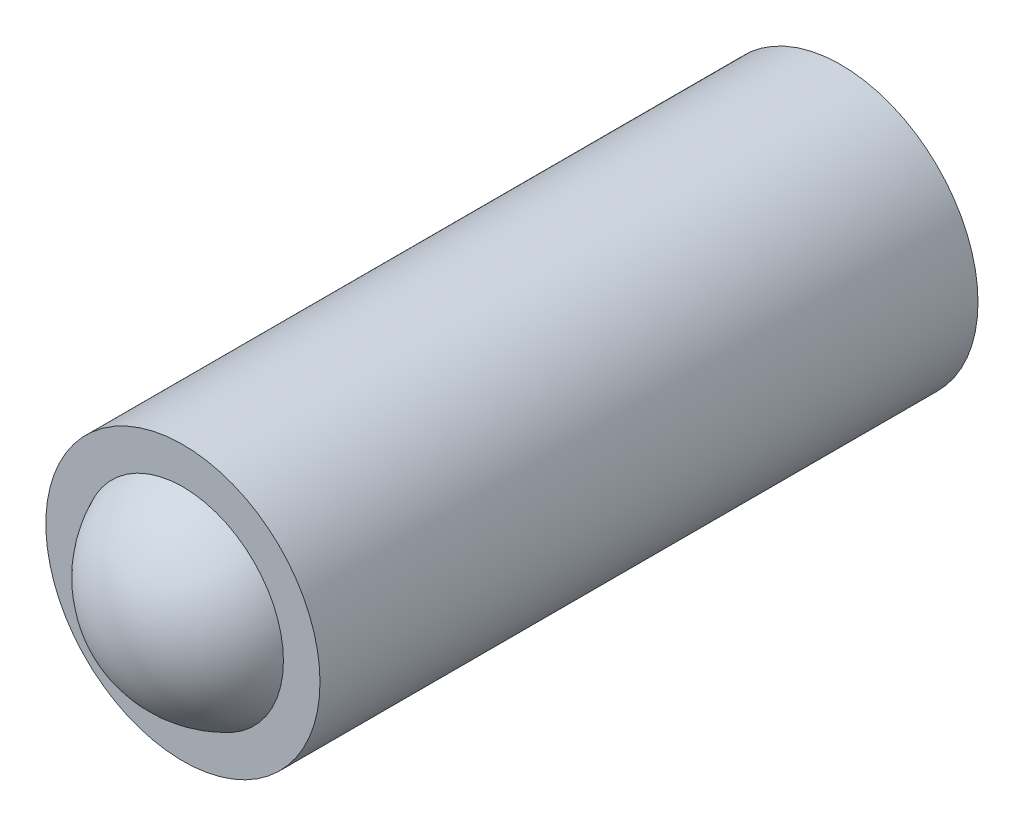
ISO-10303-21;
HEADER;
FILE_DESCRIPTION(('STEP AP214'),'2;1');
FILE_NAME('part.step','',(''),(''),'','','');
FILE_SCHEMA(('AUTOMOTIVE_DESIGN { 1 0 10303 214 1 1 1 1 }'));
ENDSEC;
DATA;
#1=APPLICATION_CONTEXT('core data for automotive mechanical design processes');
#2=APPLICATION_PROTOCOL_DEFINITION('international standard','automotive_design',2000,#1);
#3=PRODUCT_CONTEXT('',#1,'mechanical');
#4=PRODUCT('Part','Part','',(#3));
#5=PRODUCT_RELATED_PRODUCT_CATEGORY('part','',(#4));
#6=PRODUCT_DEFINITION_FORMATION('','',#4);
#7=PRODUCT_DEFINITION_CONTEXT('part definition',#1,'design');
#8=PRODUCT_DEFINITION('design','',#6,#7);
#9=PRODUCT_DEFINITION_SHAPE('','',#8);
#10=(LENGTH_UNIT() NAMED_UNIT(*) SI_UNIT(.MILLI.,.METRE.));
#11=(NAMED_UNIT(*) PLANE_ANGLE_UNIT() SI_UNIT($,.RADIAN.));
#12=(NAMED_UNIT(*) SI_UNIT($,.STERADIAN.) SOLID_ANGLE_UNIT());
#13=UNCERTAINTY_MEASURE_WITH_UNIT(LENGTH_MEASURE(1.E-05),#10,'distance_accuracy_value','');
#14=(GEOMETRIC_REPRESENTATION_CONTEXT(3) GLOBAL_UNCERTAINTY_ASSIGNED_CONTEXT((#13)) GLOBAL_UNIT_ASSIGNED_CONTEXT((#10,
#11,#12)) REPRESENTATION_CONTEXT('',''));
#15=CARTESIAN_POINT('',(0.,0.,0.));
#16=DIRECTION('',(0.,0.,1.));
#17=DIRECTION('',(1.,0.,0.));
#18=AXIS2_PLACEMENT_3D('',#15,#16,#17);
#19=CARTESIAN_POINT('',(0.,0.,-5.2));
#20=DIRECTION('',(0.,0.,1.));
#21=DIRECTION('',(0.,-1.,0.));
#22=AXIS2_PLACEMENT_3D('',#19,#20,#21);
#23=SPHERICAL_SURFACE('',#22,2.);
#24=CARTESIAN_POINT('',(0.,0.,-6.));
#25=DIRECTION('',(0.,0.,1.));
#26=DIRECTION('',(1.,0.,0.));
#27=AXIS2_PLACEMENT_3D('',#24,#25,#26);
#28=CIRCLE('',#27,1.83303027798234);
#29=CARTESIAN_POINT('',(1.83303027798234,0.,-6.));
#30=VERTEX_POINT('',#29);
#31=EDGE_CURVE('E26',#30,#30,#28,.T.);
#32=ORIENTED_EDGE('',*,*,#31,.F.);
#33=EDGE_LOOP('',(#32));
#34=FACE_BOUND('',#33,.T.);
#35=ADVANCED_FACE('F12',(#34),#23,.T.);
#36=CARTESIAN_POINT('',(0.,0.,5.2));
#37=DIRECTION('',(0.,0.,1.));
#38=DIRECTION('',(0.,1.,0.));
#39=AXIS2_PLACEMENT_3D('',#36,#37,#38);
#40=SPHERICAL_SURFACE('',#39,2.);
#41=CARTESIAN_POINT('',(0.,0.,6.));
#42=DIRECTION('',(0.,0.,1.));
#43=DIRECTION('',(1.,0.,0.));
#44=AXIS2_PLACEMENT_3D('',#41,#42,#43);
#45=CIRCLE('',#44,1.83303027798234);
#46=CARTESIAN_POINT('',(1.83303027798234,0.,6.));
#47=VERTEX_POINT('',#46);
#48=EDGE_CURVE('E8',#47,#47,#45,.T.);
#49=ORIENTED_EDGE('',*,*,#48,.T.);
#50=EDGE_LOOP('',(#49));
#51=FACE_BOUND('',#50,.T.);
#52=ADVANCED_FACE('F36',(#51),#40,.T.);
#53=CARTESIAN_POINT('',(0.,-1.83303027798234,6.));
#54=DIRECTION('',(0.,0.,1.));
#55=DIRECTION('',(1.,0.,0.));
#56=AXIS2_PLACEMENT_3D('',#53,#54,#55);
#57=PLANE('',#56);
#58=CARTESIAN_POINT('',(0.,0.,6.));
#59=DIRECTION('',(0.,0.,1.));
#60=DIRECTION('',(1.,0.,0.));
#61=AXIS2_PLACEMENT_3D('',#58,#59,#60);
#62=CIRCLE('',#61,2.5);
#63=CARTESIAN_POINT('',(2.5,0.,6.));
#64=VERTEX_POINT('',#63);
#65=EDGE_CURVE('E18',#64,#64,#62,.T.);
#66=ORIENTED_EDGE('',*,*,#65,.T.);
#67=EDGE_LOOP('',(#66));
#68=FACE_BOUND('',#67,.T.);
#69=ORIENTED_EDGE('',*,*,#48,.F.);
#70=EDGE_LOOP('',(#69));
#71=FACE_BOUND('',#70,.T.);
#72=ADVANCED_FACE('F42',(#68,#71),#57,.T.);
#73=CARTESIAN_POINT('',(0.,0.,7.56311397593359));
#74=DIRECTION('',(0.,0.,1.));
#75=DIRECTION('',(1.,0.,0.));
#76=AXIS2_PLACEMENT_3D('',#73,#74,#75);
#77=CYLINDRICAL_SURFACE('',#76,2.5);
#78=CARTESIAN_POINT('',(0.,0.,-6.));
#79=DIRECTION('',(0.,0.,1.));
#80=DIRECTION('',(1.,0.,0.));
#81=AXIS2_PLACEMENT_3D('',#78,#79,#80);
#82=CIRCLE('',#81,2.5);
#83=CARTESIAN_POINT('',(2.5,0.,-6.));
#84=VERTEX_POINT('',#83);
#85=EDGE_CURVE('E22',#84,#84,#82,.T.);
#86=ORIENTED_EDGE('',*,*,#85,.T.);
#87=EDGE_LOOP('',(#86));
#88=FACE_BOUND('',#87,.T.);
#89=ORIENTED_EDGE('',*,*,#65,.F.);
#90=EDGE_LOOP('',(#89));
#91=FACE_BOUND('',#90,.T.);
#92=ADVANCED_FACE('F47',(#88,#91),#77,.T.);
#93=CARTESIAN_POINT('',(0.,-1.83303027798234,-6.));
#94=DIRECTION('',(0.,0.,-1.));
#95=DIRECTION('',(-1.,0.,0.));
#96=AXIS2_PLACEMENT_3D('',#93,#94,#95);
#97=PLANE('',#96);
#98=ORIENTED_EDGE('',*,*,#31,.T.);
#99=EDGE_LOOP('',(#98));
#100=FACE_BOUND('',#99,.T.);
#101=ORIENTED_EDGE('',*,*,#85,.F.);
#102=EDGE_LOOP('',(#101));
#103=FACE_BOUND('',#102,.T.);
#104=ADVANCED_FACE('F32',(#100,#103),#97,.T.);
#105=CLOSED_SHELL('',(#35,#52,#72,#92,#104));
#106=MANIFOLD_SOLID_BREP('B1',#105);
#107=ADVANCED_BREP_SHAPE_REPRESENTATION('',(#18,#106),#14);
#108=SHAPE_DEFINITION_REPRESENTATION(#9,#107);
ENDSEC;
END-ISO-10303-21;
